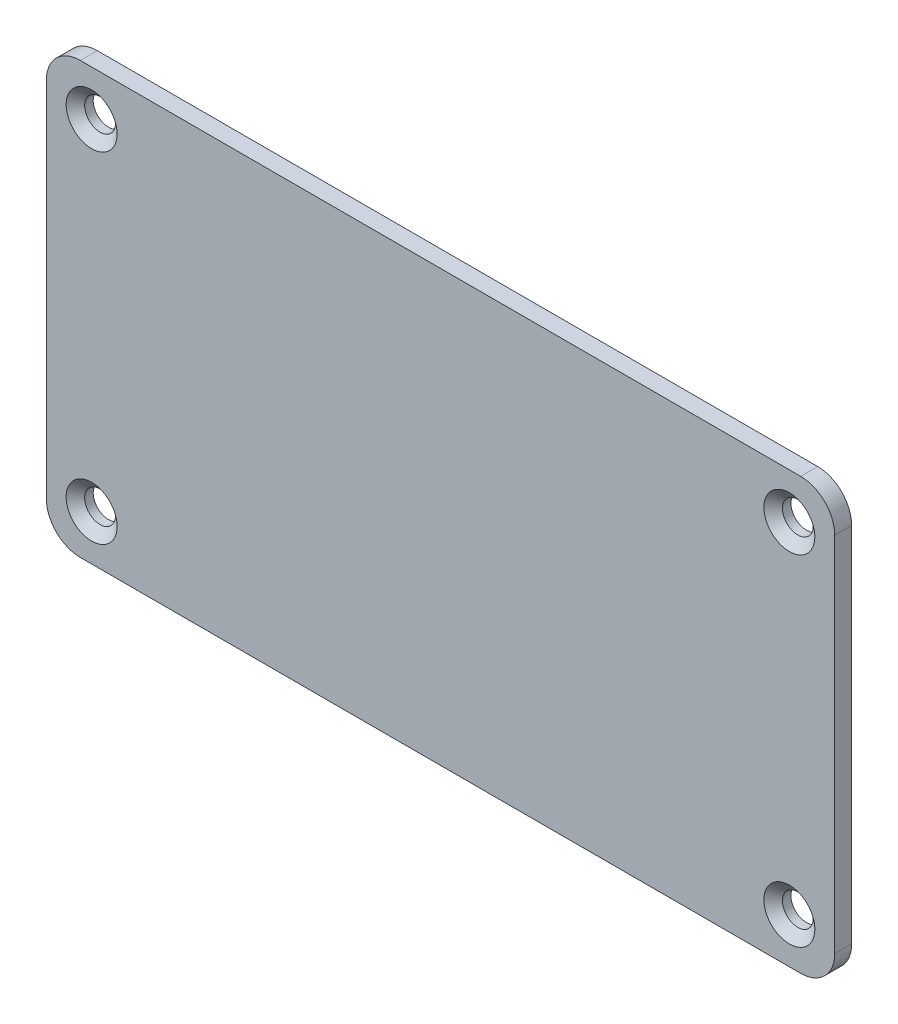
ISO-10303-21;
HEADER;
FILE_DESCRIPTION(('STEP AP214'),'2;1');
FILE_NAME('part.step','',(''),(''),'','','');
FILE_SCHEMA(('AUTOMOTIVE_DESIGN { 1 0 10303 214 1 1 1 1 }'));
ENDSEC;
DATA;
#1=APPLICATION_CONTEXT('core data for automotive mechanical design processes');
#2=APPLICATION_PROTOCOL_DEFINITION('international standard','automotive_design',2000,#1);
#3=PRODUCT_CONTEXT('',#1,'mechanical');
#4=PRODUCT('Part','Part','',(#3));
#5=PRODUCT_RELATED_PRODUCT_CATEGORY('part','',(#4));
#6=PRODUCT_DEFINITION_FORMATION('','',#4);
#7=PRODUCT_DEFINITION_CONTEXT('part definition',#1,'design');
#8=PRODUCT_DEFINITION('design','',#6,#7);
#9=PRODUCT_DEFINITION_SHAPE('','',#8);
#10=(LENGTH_UNIT() NAMED_UNIT(*) SI_UNIT(.MILLI.,.METRE.));
#11=(NAMED_UNIT(*) PLANE_ANGLE_UNIT() SI_UNIT($,.RADIAN.));
#12=(NAMED_UNIT(*) SI_UNIT($,.STERADIAN.) SOLID_ANGLE_UNIT());
#13=UNCERTAINTY_MEASURE_WITH_UNIT(LENGTH_MEASURE(1.E-05),#10,'distance_accuracy_value','');
#14=(GEOMETRIC_REPRESENTATION_CONTEXT(3) GLOBAL_UNCERTAINTY_ASSIGNED_CONTEXT((#13)) GLOBAL_UNIT_ASSIGNED_CONTEXT((#10,
#11,#12)) REPRESENTATION_CONTEXT('',''));
#15=CARTESIAN_POINT('',(0.,0.,0.));
#16=DIRECTION('',(0.,0.,1.));
#17=DIRECTION('',(1.,0.,0.));
#18=AXIS2_PLACEMENT_3D('',#15,#16,#17);
#19=CARTESIAN_POINT('',(0.,-32.385,-1.90500000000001));
#20=DIRECTION('',(0.,0.,-1.));
#21=DIRECTION('',(0.,-1.,0.));
#22=AXIS2_PLACEMENT_3D('',#19,#20,#21);
#23=PLANE('',#22);
#24=CARTESIAN_POINT('',(-39.0426131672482,-12.3801695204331,-1.90500000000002));
#25=DIRECTION('',(0.,0.,1.));
#26=DIRECTION('',(1.,0.,0.));
#27=AXIS2_PLACEMENT_3D('',#24,#25,#26);
#28=CIRCLE('',#27,1.7272);
#29=CARTESIAN_POINT('',(-37.3154131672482,-12.3801695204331,-1.90500000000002));
#30=VERTEX_POINT('',#29);
#31=EDGE_CURVE('E201',#30,#30,#28,.T.);
#32=ORIENTED_EDGE('',*,*,#31,.T.);
#33=EDGE_LOOP('',(#32));
#34=FACE_BOUND('',#33,.T.);
#35=CARTESIAN_POINT('',(39.1893868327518,-12.3801695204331,-1.90500000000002));
#36=DIRECTION('',(0.,0.,1.));
#37=DIRECTION('',(1.,0.,0.));
#38=AXIS2_PLACEMENT_3D('',#35,#36,#37);
#39=CIRCLE('',#38,1.7272);
#40=CARTESIAN_POINT('',(40.9165868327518,-12.3801695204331,-1.90500000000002));
#41=VERTEX_POINT('',#40);
#42=EDGE_CURVE('E192',#41,#41,#39,.T.);
#43=ORIENTED_EDGE('',*,*,#42,.T.);
#44=EDGE_LOOP('',(#43));
#45=FACE_BOUND('',#44,.T.);
#46=CARTESIAN_POINT('',(-39.0426131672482,-50.4801695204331,-1.90500000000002));
#47=DIRECTION('',(0.,0.,1.));
#48=DIRECTION('',(1.,0.,0.));
#49=AXIS2_PLACEMENT_3D('',#46,#47,#48);
#50=CIRCLE('',#49,1.7272);
#51=CARTESIAN_POINT('',(-37.3154131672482,-50.4801695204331,-1.90500000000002));
#52=VERTEX_POINT('',#51);
#53=EDGE_CURVE('E183',#52,#52,#50,.T.);
#54=ORIENTED_EDGE('',*,*,#53,.T.);
#55=EDGE_LOOP('',(#54));
#56=FACE_BOUND('',#55,.T.);
#57=CARTESIAN_POINT('',(39.1893868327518,-50.4801695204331,-1.90500000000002));
#58=DIRECTION('',(0.,0.,1.));
#59=DIRECTION('',(1.,0.,0.));
#60=AXIS2_PLACEMENT_3D('',#57,#58,#59);
#61=CIRCLE('',#60,1.7272);
#62=CARTESIAN_POINT('',(40.9165868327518,-50.4801695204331,-1.90500000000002));
#63=VERTEX_POINT('',#62);
#64=EDGE_CURVE('E147',#63,#63,#61,.T.);
#65=ORIENTED_EDGE('',*,*,#64,.T.);
#66=EDGE_LOOP('',(#65));
#67=FACE_BOUND('',#66,.T.);
#68=DIRECTION('',(0.,-1.,0.));
#69=VECTOR('',#68,1.);
#70=CARTESIAN_POINT('',(-44.1226131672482,-7.30016952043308,-1.90500000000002));
#71=LINE('',#70,#69);
#72=CARTESIAN_POINT('',(-44.1226131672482,-11.1101695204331,-1.90500000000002));
#73=VERTEX_POINT('',#72);
#74=CARTESIAN_POINT('',(-44.1226131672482,-51.7501695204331,-1.90500000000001));
#75=VERTEX_POINT('',#74);
#76=EDGE_CURVE('E118',#73,#75,#71,.T.);
#77=ORIENTED_EDGE('',*,*,#76,.F.);
#78=CARTESIAN_POINT('',(-40.3126131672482,-11.1101695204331,-1.90500000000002));
#79=DIRECTION('',(0.,0.,-1.));
#80=DIRECTION('',(0.,1.,0.));
#81=AXIS2_PLACEMENT_3D('',#78,#79,#80);
#82=CIRCLE('',#81,3.81);
#83=CARTESIAN_POINT('',(-40.3126131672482,-7.30016952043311,-1.90500000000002));
#84=VERTEX_POINT('',#83);
#85=EDGE_CURVE('E117',#73,#84,#82,.T.);
#86=ORIENTED_EDGE('',*,*,#85,.T.);
#87=DIRECTION('',(-1.,0.,0.));
#88=VECTOR('',#87,1.);
#89=CARTESIAN_POINT('',(-44.1226131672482,-7.30016952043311,-1.90500000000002));
#90=LINE('',#89,#88);
#91=CARTESIAN_POINT('',(40.4593868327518,-7.30016952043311,-1.90500000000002));
#92=VERTEX_POINT('',#91);
#93=EDGE_CURVE('E104',#92,#84,#90,.T.);
#94=ORIENTED_EDGE('',*,*,#93,.F.);
#95=CARTESIAN_POINT('',(40.4593868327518,-11.1101695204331,-1.90500000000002));
#96=DIRECTION('',(0.,0.,-1.));
#97=DIRECTION('',(0.,1.,0.));
#98=AXIS2_PLACEMENT_3D('',#95,#96,#97);
#99=CIRCLE('',#98,3.81);
#100=CARTESIAN_POINT('',(44.2693868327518,-11.1101695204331,-1.90500000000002));
#101=VERTEX_POINT('',#100);
#102=EDGE_CURVE('E114',#92,#101,#99,.T.);
#103=ORIENTED_EDGE('',*,*,#102,.T.);
#104=DIRECTION('',(0.,1.,0.));
#105=VECTOR('',#104,1.);
#106=CARTESIAN_POINT('',(44.2693868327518,-7.30016952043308,-1.90500000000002));
#107=LINE('',#106,#105);
#108=CARTESIAN_POINT('',(44.2693868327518,-51.7501695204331,-1.90500000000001));
#109=VERTEX_POINT('',#108);
#110=EDGE_CURVE('E111',#109,#101,#107,.T.);
#111=ORIENTED_EDGE('',*,*,#110,.F.);
#112=CARTESIAN_POINT('',(40.4593868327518,-51.7501695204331,-1.90500000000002));
#113=DIRECTION('',(0.,0.,-1.));
#114=DIRECTION('',(0.,1.,0.));
#115=AXIS2_PLACEMENT_3D('',#112,#113,#114);
#116=CIRCLE('',#115,3.81);
#117=CARTESIAN_POINT('',(40.4593868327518,-55.5601695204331,-1.90500000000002));
#118=VERTEX_POINT('',#117);
#119=EDGE_CURVE('E48',#109,#118,#116,.T.);
#120=ORIENTED_EDGE('',*,*,#119,.T.);
#121=DIRECTION('',(1.,0.,0.));
#122=VECTOR('',#121,1.);
#123=CARTESIAN_POINT('',(-44.1226131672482,-55.5601695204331,-1.90500000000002));
#124=LINE('',#123,#122);
#125=CARTESIAN_POINT('',(-40.3126131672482,-55.5601695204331,-1.90500000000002));
#126=VERTEX_POINT('',#125);
#127=EDGE_CURVE('E157',#126,#118,#124,.T.);
#128=ORIENTED_EDGE('',*,*,#127,.F.);
#129=CARTESIAN_POINT('',(-40.3126131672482,-51.7501695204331,-1.90500000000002));
#130=DIRECTION('',(0.,0.,-1.));
#131=DIRECTION('',(0.,1.,0.));
#132=AXIS2_PLACEMENT_3D('',#129,#130,#131);
#133=CIRCLE('',#132,3.81);
#134=EDGE_CURVE('E125',#126,#75,#133,.T.);
#135=ORIENTED_EDGE('',*,*,#134,.T.);
#136=EDGE_LOOP('',(#77,#86,#94,#103,#111,#120,#128,#135));
#137=FACE_BOUND('',#136,.T.);
#138=ADVANCED_FACE('F33',(#34,#45,#56,#67,#137),#23,.T.);
#139=CARTESIAN_POINT('',(0.,0.,0.));
#140=DIRECTION('',(0.,0.,1.));
#141=DIRECTION('',(1.,0.,0.));
#142=AXIS2_PLACEMENT_3D('',#139,#140,#141);
#143=PLANE('',#142);
#144=CARTESIAN_POINT('',(-39.0426131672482,-12.3801695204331,0.));
#145=DIRECTION('',(0.,0.,1.));
#146=DIRECTION('',(1.,0.,0.));
#147=AXIS2_PLACEMENT_3D('',#144,#145,#146);
#148=CIRCLE('',#147,2.8575);
#149=CARTESIAN_POINT('',(-36.1851131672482,-12.3801695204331,0.));
#150=VERTEX_POINT('',#149);
#151=EDGE_CURVE('E207',#150,#150,#148,.T.);
#152=ORIENTED_EDGE('',*,*,#151,.F.);
#153=EDGE_LOOP('',(#152));
#154=FACE_BOUND('',#153,.T.);
#155=CARTESIAN_POINT('',(39.1893868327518,-12.3801695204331,0.));
#156=DIRECTION('',(0.,0.,1.));
#157=DIRECTION('',(1.,0.,0.));
#158=AXIS2_PLACEMENT_3D('',#155,#156,#157);
#159=CIRCLE('',#158,2.8575);
#160=CARTESIAN_POINT('',(42.0468868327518,-12.3801695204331,0.));
#161=VERTEX_POINT('',#160);
#162=EDGE_CURVE('E198',#161,#161,#159,.T.);
#163=ORIENTED_EDGE('',*,*,#162,.F.);
#164=EDGE_LOOP('',(#163));
#165=FACE_BOUND('',#164,.T.);
#166=CARTESIAN_POINT('',(-39.0426131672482,-50.4801695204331,0.));
#167=DIRECTION('',(0.,0.,1.));
#168=DIRECTION('',(1.,0.,0.));
#169=AXIS2_PLACEMENT_3D('',#166,#167,#168);
#170=CIRCLE('',#169,2.8575);
#171=CARTESIAN_POINT('',(-36.1851131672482,-50.4801695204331,0.));
#172=VERTEX_POINT('',#171);
#173=EDGE_CURVE('E189',#172,#172,#170,.T.);
#174=ORIENTED_EDGE('',*,*,#173,.F.);
#175=EDGE_LOOP('',(#174));
#176=FACE_BOUND('',#175,.T.);
#177=CARTESIAN_POINT('',(39.1893868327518,-50.4801695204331,0.));
#178=DIRECTION('',(0.,0.,1.));
#179=DIRECTION('',(1.,0.,0.));
#180=AXIS2_PLACEMENT_3D('',#177,#178,#179);
#181=CIRCLE('',#180,2.8575);
#182=CARTESIAN_POINT('',(42.0468868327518,-50.4801695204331,0.));
#183=VERTEX_POINT('',#182);
#184=EDGE_CURVE('E180',#183,#183,#181,.T.);
#185=ORIENTED_EDGE('',*,*,#184,.F.);
#186=EDGE_LOOP('',(#185));
#187=FACE_BOUND('',#186,.T.);
#188=DIRECTION('',(-1.,0.,0.));
#189=VECTOR('',#188,1.);
#190=CARTESIAN_POINT('',(-44.1226131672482,-7.30016952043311,0.));
#191=LINE('',#190,#189);
#192=CARTESIAN_POINT('',(40.4593868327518,-7.30016952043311,0.));
#193=VERTEX_POINT('',#192);
#194=CARTESIAN_POINT('',(-40.3126131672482,-7.30016952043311,0.));
#195=VERTEX_POINT('',#194);
#196=EDGE_CURVE('E107',#193,#195,#191,.T.);
#197=ORIENTED_EDGE('',*,*,#196,.T.);
#198=CARTESIAN_POINT('',(-40.3126131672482,-11.1101695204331,0.));
#199=DIRECTION('',(0.,0.,1.));
#200=DIRECTION('',(1.,0.,0.));
#201=AXIS2_PLACEMENT_3D('',#198,#199,#200);
#202=CIRCLE('',#201,3.81);
#203=CARTESIAN_POINT('',(-44.1226131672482,-11.1101695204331,0.));
#204=VERTEX_POINT('',#203);
#205=EDGE_CURVE('E166',#195,#204,#202,.T.);
#206=ORIENTED_EDGE('',*,*,#205,.T.);
#207=DIRECTION('',(0.,-1.,0.));
#208=VECTOR('',#207,1.);
#209=CARTESIAN_POINT('',(-44.1226131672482,-7.30016952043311,0.));
#210=LINE('',#209,#208);
#211=CARTESIAN_POINT('',(-44.1226131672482,-51.7501695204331,0.));
#212=VERTEX_POINT('',#211);
#213=EDGE_CURVE('E149',#204,#212,#210,.T.);
#214=ORIENTED_EDGE('',*,*,#213,.T.);
#215=CARTESIAN_POINT('',(-40.3126131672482,-51.7501695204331,0.));
#216=DIRECTION('',(0.,0.,1.));
#217=DIRECTION('',(1.,0.,0.));
#218=AXIS2_PLACEMENT_3D('',#215,#216,#217);
#219=CIRCLE('',#218,3.81);
#220=CARTESIAN_POINT('',(-40.3126131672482,-55.5601695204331,0.));
#221=VERTEX_POINT('',#220);
#222=EDGE_CURVE('E164',#212,#221,#219,.T.);
#223=ORIENTED_EDGE('',*,*,#222,.T.);
#224=DIRECTION('',(1.,0.,0.));
#225=VECTOR('',#224,1.);
#226=CARTESIAN_POINT('',(-44.1226131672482,-55.5601695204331,0.));
#227=LINE('',#226,#225);
#228=CARTESIAN_POINT('',(40.4593868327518,-55.5601695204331,0.));
#229=VERTEX_POINT('',#228);
#230=EDGE_CURVE('E119',#221,#229,#227,.T.);
#231=ORIENTED_EDGE('',*,*,#230,.T.);
#232=CARTESIAN_POINT('',(40.4593868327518,-51.7501695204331,0.));
#233=DIRECTION('',(0.,0.,1.));
#234=DIRECTION('',(1.,0.,0.));
#235=AXIS2_PLACEMENT_3D('',#232,#233,#234);
#236=CIRCLE('',#235,3.81);
#237=CARTESIAN_POINT('',(44.2693868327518,-51.7501695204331,0.));
#238=VERTEX_POINT('',#237);
#239=EDGE_CURVE('E146',#229,#238,#236,.T.);
#240=ORIENTED_EDGE('',*,*,#239,.T.);
#241=DIRECTION('',(0.,1.,0.));
#242=VECTOR('',#241,1.);
#243=CARTESIAN_POINT('',(44.2693868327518,-7.30016952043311,0.));
#244=LINE('',#243,#242);
#245=CARTESIAN_POINT('',(44.2693868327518,-11.1101695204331,0.));
#246=VERTEX_POINT('',#245);
#247=EDGE_CURVE('E140',#238,#246,#244,.T.);
#248=ORIENTED_EDGE('',*,*,#247,.T.);
#249=CARTESIAN_POINT('',(40.4593868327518,-11.1101695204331,0.));
#250=DIRECTION('',(0.,0.,1.));
#251=DIRECTION('',(1.,0.,0.));
#252=AXIS2_PLACEMENT_3D('',#249,#250,#251);
#253=CIRCLE('',#252,3.81);
#254=EDGE_CURVE('E144',#246,#193,#253,.T.);
#255=ORIENTED_EDGE('',*,*,#254,.T.);
#256=EDGE_LOOP('',(#197,#206,#214,#223,#231,#240,#248,#255));
#257=FACE_BOUND('',#256,.T.);
#258=ADVANCED_FACE('F143',(#154,#165,#176,#187,#257),#143,.T.);
#259=CARTESIAN_POINT('',(-44.1226131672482,-7.30016952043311,-102.613357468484));
#260=DIRECTION('',(0.,1.,0.));
#261=DIRECTION('',(0.,0.,1.));
#262=AXIS2_PLACEMENT_3D('',#259,#260,#261);
#263=PLANE('',#262);
#264=ORIENTED_EDGE('',*,*,#93,.T.);
#265=DIRECTION('',(0.,0.,1.));
#266=VECTOR('',#265,1.);
#267=CARTESIAN_POINT('',(-40.3126131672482,-7.30016952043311,-102.613357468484));
#268=LINE('',#267,#266);
#269=EDGE_CURVE('E110',#84,#195,#268,.T.);
#270=ORIENTED_EDGE('',*,*,#269,.T.);
#271=ORIENTED_EDGE('',*,*,#196,.F.);
#272=DIRECTION('',(0.,0.,1.));
#273=VECTOR('',#272,1.);
#274=CARTESIAN_POINT('',(40.4593868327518,-7.30016952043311,-102.613357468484));
#275=LINE('',#274,#273);
#276=EDGE_CURVE('E100',#193,#92,#275,.F.);
#277=ORIENTED_EDGE('',*,*,#276,.T.);
#278=EDGE_LOOP('',(#264,#270,#271,#277));
#279=FACE_BOUND('',#278,.T.);
#280=ADVANCED_FACE('F102',(#279),#263,.T.);
#281=CARTESIAN_POINT('',(-44.1226131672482,-7.30016952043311,-102.613357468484));
#282=DIRECTION('',(-1.,0.,0.));
#283=DIRECTION('',(0.,-1.,0.));
#284=AXIS2_PLACEMENT_3D('',#281,#282,#283);
#285=PLANE('',#284);
#286=ORIENTED_EDGE('',*,*,#213,.F.);
#287=DIRECTION('',(0.,0.,1.));
#288=VECTOR('',#287,1.);
#289=CARTESIAN_POINT('',(-44.1226131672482,-11.1101695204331,-102.613357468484));
#290=LINE('',#289,#288);
#291=EDGE_CURVE('E123',#204,#73,#290,.F.);
#292=ORIENTED_EDGE('',*,*,#291,.T.);
#293=ORIENTED_EDGE('',*,*,#76,.T.);
#294=DIRECTION('',(0.,0.,1.));
#295=VECTOR('',#294,1.);
#296=CARTESIAN_POINT('',(-44.1226131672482,-51.7501695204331,-102.613357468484));
#297=LINE('',#296,#295);
#298=EDGE_CURVE('E127',#75,#212,#297,.T.);
#299=ORIENTED_EDGE('',*,*,#298,.T.);
#300=EDGE_LOOP('',(#286,#292,#293,#299));
#301=FACE_BOUND('',#300,.T.);
#302=ADVANCED_FACE('F172',(#301),#285,.T.);
#303=CARTESIAN_POINT('',(-44.1226131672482,-55.5601695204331,-102.613357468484));
#304=DIRECTION('',(0.,-1.,0.));
#305=DIRECTION('',(0.,0.,-1.));
#306=AXIS2_PLACEMENT_3D('',#303,#304,#305);
#307=PLANE('',#306);
#308=ORIENTED_EDGE('',*,*,#230,.F.);
#309=DIRECTION('',(0.,0.,1.));
#310=VECTOR('',#309,1.);
#311=CARTESIAN_POINT('',(-40.3126131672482,-55.5601695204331,-102.613357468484));
#312=LINE('',#311,#310);
#313=EDGE_CURVE('E55',#221,#126,#312,.F.);
#314=ORIENTED_EDGE('',*,*,#313,.T.);
#315=ORIENTED_EDGE('',*,*,#127,.T.);
#316=DIRECTION('',(0.,0.,1.));
#317=VECTOR('',#316,1.);
#318=CARTESIAN_POINT('',(40.4593868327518,-55.5601695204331,-102.613357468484));
#319=LINE('',#318,#317);
#320=EDGE_CURVE('E133',#118,#229,#319,.T.);
#321=ORIENTED_EDGE('',*,*,#320,.T.);
#322=EDGE_LOOP('',(#308,#314,#315,#321));
#323=FACE_BOUND('',#322,.T.);
#324=ADVANCED_FACE('F260',(#323),#307,.T.);
#325=CARTESIAN_POINT('',(44.2693868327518,-7.30016952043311,-102.613357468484));
#326=DIRECTION('',(1.,0.,0.));
#327=DIRECTION('',(0.,1.,0.));
#328=AXIS2_PLACEMENT_3D('',#325,#326,#327);
#329=PLANE('',#328);
#330=ORIENTED_EDGE('',*,*,#247,.F.);
#331=DIRECTION('',(0.,0.,1.));
#332=VECTOR('',#331,1.);
#333=CARTESIAN_POINT('',(44.2693868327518,-51.7501695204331,-102.613357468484));
#334=LINE('',#333,#332);
#335=EDGE_CURVE('E11',#238,#109,#334,.F.);
#336=ORIENTED_EDGE('',*,*,#335,.T.);
#337=ORIENTED_EDGE('',*,*,#110,.T.);
#338=DIRECTION('',(0.,0.,1.));
#339=VECTOR('',#338,1.);
#340=CARTESIAN_POINT('',(44.2693868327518,-11.1101695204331,-102.613357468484));
#341=LINE('',#340,#339);
#342=EDGE_CURVE('E41',#101,#246,#341,.T.);
#343=ORIENTED_EDGE('',*,*,#342,.T.);
#344=EDGE_LOOP('',(#330,#336,#337,#343));
#345=FACE_BOUND('',#344,.T.);
#346=ADVANCED_FACE('F139',(#345),#329,.T.);
#347=CARTESIAN_POINT('',(39.1893868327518,-50.4801695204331,0.));
#348=DIRECTION('',(0.,0.,1.));
#349=DIRECTION('',(1.,0.,0.));
#350=AXIS2_PLACEMENT_3D('',#347,#348,#349);
#351=CYLINDRICAL_SURFACE('',#350,1.72719999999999);
#352=ORIENTED_EDGE('',*,*,#64,.F.);
#353=EDGE_LOOP('',(#352));
#354=FACE_BOUND('',#353,.T.);
#355=CARTESIAN_POINT('',(39.1893868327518,-50.4801695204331,-0.948434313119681));
#356=DIRECTION('',(0.,0.,1.));
#357=DIRECTION('',(1.,0.,0.));
#358=AXIS2_PLACEMENT_3D('',#355,#356,#357);
#359=CIRCLE('',#358,1.72719999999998);
#360=CARTESIAN_POINT('',(40.9165868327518,-50.4801695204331,-0.948434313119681));
#361=VERTEX_POINT('',#360);
#362=EDGE_CURVE('E152',#361,#361,#359,.T.);
#363=ORIENTED_EDGE('',*,*,#362,.T.);
#364=EDGE_LOOP('',(#363));
#365=FACE_BOUND('',#364,.T.);
#366=ADVANCED_FACE('F225',(#354,#365),#351,.F.);
#367=CARTESIAN_POINT('',(39.1893868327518,-50.4801695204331,0.));
#368=DIRECTION('',(0.,0.,1.));
#369=DIRECTION('',(1.,0.,0.));
#370=AXIS2_PLACEMENT_3D('',#367,#368,#369);
#371=CONICAL_SURFACE('',#370,2.8575,0.87266462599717);
#372=ORIENTED_EDGE('',*,*,#362,.F.);
#373=EDGE_LOOP('',(#372));
#374=FACE_BOUND('',#373,.T.);
#375=ORIENTED_EDGE('',*,*,#184,.T.);
#376=EDGE_LOOP('',(#375));
#377=FACE_BOUND('',#376,.T.);
#378=ADVANCED_FACE('F222',(#374,#377),#371,.F.);
#379=CARTESIAN_POINT('',(-39.0426131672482,-50.4801695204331,0.));
#380=DIRECTION('',(0.,0.,1.));
#381=DIRECTION('',(1.,0.,0.));
#382=AXIS2_PLACEMENT_3D('',#379,#380,#381);
#383=CYLINDRICAL_SURFACE('',#382,1.72719999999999);
#384=ORIENTED_EDGE('',*,*,#53,.F.);
#385=EDGE_LOOP('',(#384));
#386=FACE_BOUND('',#385,.T.);
#387=CARTESIAN_POINT('',(-39.0426131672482,-50.4801695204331,-0.948434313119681));
#388=DIRECTION('',(0.,0.,1.));
#389=DIRECTION('',(1.,0.,0.));
#390=AXIS2_PLACEMENT_3D('',#387,#388,#389);
#391=CIRCLE('',#390,1.72719999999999);
#392=CARTESIAN_POINT('',(-37.3154131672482,-50.4801695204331,-0.948434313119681));
#393=VERTEX_POINT('',#392);
#394=EDGE_CURVE('E186',#393,#393,#391,.T.);
#395=ORIENTED_EDGE('',*,*,#394,.T.);
#396=EDGE_LOOP('',(#395));
#397=FACE_BOUND('',#396,.T.);
#398=ADVANCED_FACE('F224',(#386,#397),#383,.F.);
#399=CARTESIAN_POINT('',(-39.0426131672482,-50.4801695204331,0.));
#400=DIRECTION('',(0.,0.,1.));
#401=DIRECTION('',(1.,0.,0.));
#402=AXIS2_PLACEMENT_3D('',#399,#400,#401);
#403=CONICAL_SURFACE('',#402,2.8575,0.872664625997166);
#404=ORIENTED_EDGE('',*,*,#394,.F.);
#405=EDGE_LOOP('',(#404));
#406=FACE_BOUND('',#405,.T.);
#407=ORIENTED_EDGE('',*,*,#173,.T.);
#408=EDGE_LOOP('',(#407));
#409=FACE_BOUND('',#408,.T.);
#410=ADVANCED_FACE('F232',(#406,#409),#403,.F.);
#411=CARTESIAN_POINT('',(39.1893868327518,-12.3801695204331,0.));
#412=DIRECTION('',(0.,0.,1.));
#413=DIRECTION('',(1.,0.,0.));
#414=AXIS2_PLACEMENT_3D('',#411,#412,#413);
#415=CYLINDRICAL_SURFACE('',#414,1.72719999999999);
#416=ORIENTED_EDGE('',*,*,#42,.F.);
#417=EDGE_LOOP('',(#416));
#418=FACE_BOUND('',#417,.T.);
#419=CARTESIAN_POINT('',(39.1893868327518,-12.3801695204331,-0.948434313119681));
#420=DIRECTION('',(0.,0.,1.));
#421=DIRECTION('',(1.,0.,0.));
#422=AXIS2_PLACEMENT_3D('',#419,#420,#421);
#423=CIRCLE('',#422,1.72719999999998);
#424=CARTESIAN_POINT('',(40.9165868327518,-12.3801695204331,-0.948434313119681));
#425=VERTEX_POINT('',#424);
#426=EDGE_CURVE('E195',#425,#425,#423,.T.);
#427=ORIENTED_EDGE('',*,*,#426,.T.);
#428=EDGE_LOOP('',(#427));
#429=FACE_BOUND('',#428,.T.);
#430=ADVANCED_FACE('F311',(#418,#429),#415,.F.);
#431=CARTESIAN_POINT('',(39.1893868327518,-12.3801695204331,0.));
#432=DIRECTION('',(0.,0.,1.));
#433=DIRECTION('',(1.,0.,0.));
#434=AXIS2_PLACEMENT_3D('',#431,#432,#433);
#435=CONICAL_SURFACE('',#434,2.8575,0.87266462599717);
#436=ORIENTED_EDGE('',*,*,#426,.F.);
#437=EDGE_LOOP('',(#436));
#438=FACE_BOUND('',#437,.T.);
#439=ORIENTED_EDGE('',*,*,#162,.T.);
#440=EDGE_LOOP('',(#439));
#441=FACE_BOUND('',#440,.T.);
#442=ADVANCED_FACE('F301',(#438,#441),#435,.F.);
#443=CARTESIAN_POINT('',(-39.0426131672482,-12.3801695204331,0.));
#444=DIRECTION('',(0.,0.,1.));
#445=DIRECTION('',(1.,0.,0.));
#446=AXIS2_PLACEMENT_3D('',#443,#444,#445);
#447=CYLINDRICAL_SURFACE('',#446,1.72719999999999);
#448=ORIENTED_EDGE('',*,*,#31,.F.);
#449=EDGE_LOOP('',(#448));
#450=FACE_BOUND('',#449,.T.);
#451=CARTESIAN_POINT('',(-39.0426131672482,-12.3801695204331,-0.948434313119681));
#452=DIRECTION('',(0.,0.,1.));
#453=DIRECTION('',(1.,0.,0.));
#454=AXIS2_PLACEMENT_3D('',#451,#452,#453);
#455=CIRCLE('',#454,1.72719999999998);
#456=CARTESIAN_POINT('',(-37.3154131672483,-12.3801695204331,-0.948434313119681));
#457=VERTEX_POINT('',#456);
#458=EDGE_CURVE('E204',#457,#457,#455,.T.);
#459=ORIENTED_EDGE('',*,*,#458,.T.);
#460=EDGE_LOOP('',(#459));
#461=FACE_BOUND('',#460,.T.);
#462=ADVANCED_FACE('F290',(#450,#461),#447,.F.);
#463=CARTESIAN_POINT('',(-39.0426131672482,-12.3801695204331,0.));
#464=DIRECTION('',(0.,0.,1.));
#465=DIRECTION('',(1.,0.,0.));
#466=AXIS2_PLACEMENT_3D('',#463,#464,#465);
#467=CONICAL_SURFACE('',#466,2.8575,0.87266462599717);
#468=ORIENTED_EDGE('',*,*,#458,.F.);
#469=EDGE_LOOP('',(#468));
#470=FACE_BOUND('',#469,.T.);
#471=ORIENTED_EDGE('',*,*,#151,.T.);
#472=EDGE_LOOP('',(#471));
#473=FACE_BOUND('',#472,.T.);
#474=ADVANCED_FACE('F211',(#470,#473),#467,.F.);
#475=CARTESIAN_POINT('',(-40.3126131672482,-11.1101695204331,-102.613357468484));
#476=DIRECTION('',(0.,0.,1.));
#477=DIRECTION('',(1.,0.,0.));
#478=AXIS2_PLACEMENT_3D('',#475,#476,#477);
#479=CYLINDRICAL_SURFACE('',#478,3.81);
#480=ORIENTED_EDGE('',*,*,#85,.F.);
#481=ORIENTED_EDGE('',*,*,#291,.F.);
#482=ORIENTED_EDGE('',*,*,#205,.F.);
#483=ORIENTED_EDGE('',*,*,#269,.F.);
#484=EDGE_LOOP('',(#480,#481,#482,#483));
#485=FACE_BOUND('',#484,.T.);
#486=ADVANCED_FACE('F247',(#485),#479,.T.);
#487=CARTESIAN_POINT('',(-40.3126131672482,-51.7501695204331,-102.613357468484));
#488=DIRECTION('',(0.,0.,1.));
#489=DIRECTION('',(1.,0.,0.));
#490=AXIS2_PLACEMENT_3D('',#487,#488,#489);
#491=CYLINDRICAL_SURFACE('',#490,3.81);
#492=ORIENTED_EDGE('',*,*,#134,.F.);
#493=ORIENTED_EDGE('',*,*,#313,.F.);
#494=ORIENTED_EDGE('',*,*,#222,.F.);
#495=ORIENTED_EDGE('',*,*,#298,.F.);
#496=EDGE_LOOP('',(#492,#493,#494,#495));
#497=FACE_BOUND('',#496,.T.);
#498=ADVANCED_FACE('F250',(#497),#491,.T.);
#499=CARTESIAN_POINT('',(40.4593868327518,-51.7501695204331,-102.613357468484));
#500=DIRECTION('',(0.,0.,1.));
#501=DIRECTION('',(1.,0.,0.));
#502=AXIS2_PLACEMENT_3D('',#499,#500,#501);
#503=CYLINDRICAL_SURFACE('',#502,3.81);
#504=ORIENTED_EDGE('',*,*,#119,.F.);
#505=ORIENTED_EDGE('',*,*,#335,.F.);
#506=ORIENTED_EDGE('',*,*,#239,.F.);
#507=ORIENTED_EDGE('',*,*,#320,.F.);
#508=EDGE_LOOP('',(#504,#505,#506,#507));
#509=FACE_BOUND('',#508,.T.);
#510=ADVANCED_FACE('F253',(#509),#503,.T.);
#511=CARTESIAN_POINT('',(40.4593868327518,-11.1101695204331,-102.613357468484));
#512=DIRECTION('',(0.,0.,1.));
#513=DIRECTION('',(1.,0.,0.));
#514=AXIS2_PLACEMENT_3D('',#511,#512,#513);
#515=CYLINDRICAL_SURFACE('',#514,3.81);
#516=ORIENTED_EDGE('',*,*,#102,.F.);
#517=ORIENTED_EDGE('',*,*,#276,.F.);
#518=ORIENTED_EDGE('',*,*,#254,.F.);
#519=ORIENTED_EDGE('',*,*,#342,.F.);
#520=EDGE_LOOP('',(#516,#517,#518,#519));
#521=FACE_BOUND('',#520,.T.);
#522=ADVANCED_FACE('F35',(#521),#515,.T.);
#523=CLOSED_SHELL('',(#138,#258,#280,#302,#324,#346,#366,#378,#398,#410,#430,#442,#462,#474,
#486,#498,#510,#522));
#524=MANIFOLD_SOLID_BREP('B2',#523);
#525=ADVANCED_BREP_SHAPE_REPRESENTATION('',(#18,#524),#14);
#526=SHAPE_DEFINITION_REPRESENTATION(#9,#525);
ENDSEC;
END-ISO-10303-21;
